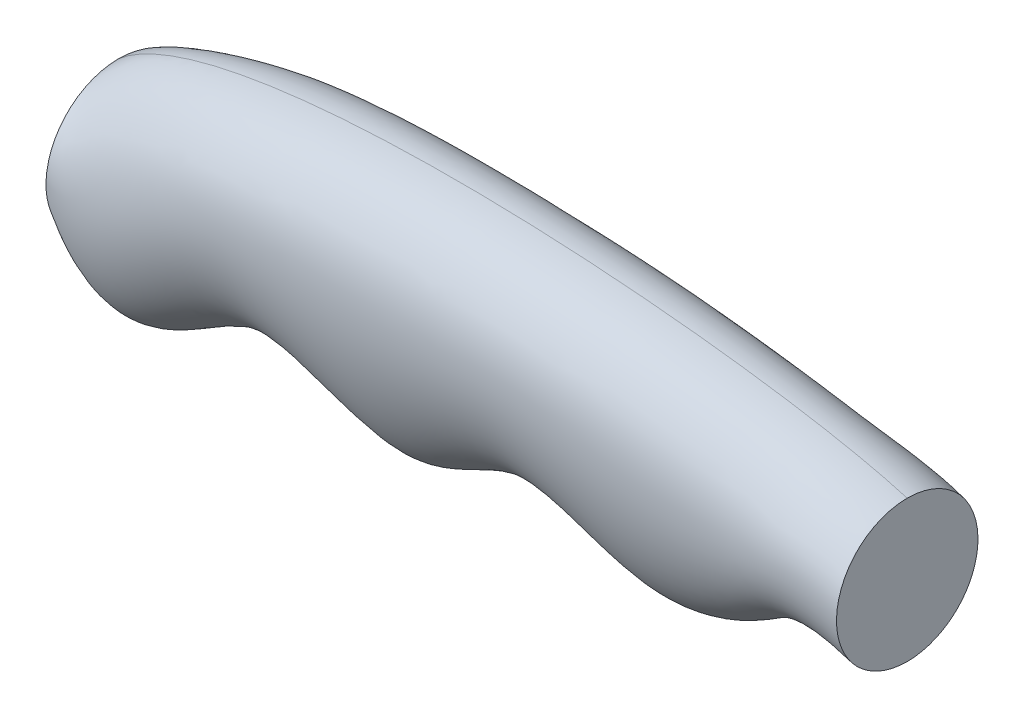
ISO-10303-21;
HEADER;
FILE_DESCRIPTION(('STEP AP214'),'2;1');
FILE_NAME('part.step','',(''),(''),'','','');
FILE_SCHEMA(('AUTOMOTIVE_DESIGN { 1 0 10303 214 1 1 1 1 }'));
ENDSEC;
DATA;
#1=APPLICATION_CONTEXT('core data for automotive mechanical design processes');
#2=APPLICATION_PROTOCOL_DEFINITION('international standard','automotive_design',2000,#1);
#3=PRODUCT_CONTEXT('',#1,'mechanical');
#4=PRODUCT('Part','Part','',(#3));
#5=PRODUCT_RELATED_PRODUCT_CATEGORY('part','',(#4));
#6=PRODUCT_DEFINITION_FORMATION('','',#4);
#7=PRODUCT_DEFINITION_CONTEXT('part definition',#1,'design');
#8=PRODUCT_DEFINITION('design','',#6,#7);
#9=PRODUCT_DEFINITION_SHAPE('','',#8);
#10=(LENGTH_UNIT() NAMED_UNIT(*) SI_UNIT(.MILLI.,.METRE.));
#11=(NAMED_UNIT(*) PLANE_ANGLE_UNIT() SI_UNIT($,.RADIAN.));
#12=(NAMED_UNIT(*) SI_UNIT($,.STERADIAN.) SOLID_ANGLE_UNIT());
#13=UNCERTAINTY_MEASURE_WITH_UNIT(LENGTH_MEASURE(1.E-05),#10,'distance_accuracy_value','');
#14=(GEOMETRIC_REPRESENTATION_CONTEXT(3) GLOBAL_UNCERTAINTY_ASSIGNED_CONTEXT((#13)) GLOBAL_UNIT_ASSIGNED_CONTEXT((#10,
#11,#12)) REPRESENTATION_CONTEXT('',''));
#15=CARTESIAN_POINT('',(0.,0.,0.));
#16=DIRECTION('',(0.,0.,1.));
#17=DIRECTION('',(1.,0.,0.));
#18=AXIS2_PLACEMENT_3D('',#15,#16,#17);
#19=CARTESIAN_POINT('',(0.,-38.8581281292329,0.));
#20=DIRECTION('',(-1.,0.,0.));
#21=DIRECTION('',(0.,0.,1.));
#22=AXIS2_PLACEMENT_3D('',#19,#20,#21);
#23=PLANE('',#22);
#24=CARTESIAN_POINT('',(0.,7.64559323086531,0.));
#25=CARTESIAN_POINT('',(0.,7.64871220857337,1.94638491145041));
#26=CARTESIAN_POINT('',(0.,6.59208279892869,5.59504325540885));
#27=CARTESIAN_POINT('',(0.,2.71240369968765,9.5263293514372));
#28=CARTESIAN_POINT('',(0.,-2.90614378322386,11.106547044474));
#29=CARTESIAN_POINT('',(0.,-8.52469126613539,9.5263293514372));
#30=CARTESIAN_POINT('',(0.,-12.4043703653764,5.59504325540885));
#31=CARTESIAN_POINT('',(0.,-13.4609997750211,1.94638491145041));
#32=CARTESIAN_POINT('',(0.,-13.457880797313,0.));
#33=B_SPLINE_CURVE_WITH_KNOTS('',3,(#24,#25,#26,#27,#28,#29,#30,#31,#32),.UNSPECIFIED.,.F.,.F.,
(4,1,1,1,1,1,4),(0.,0.166666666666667,0.333333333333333,0.5,0.666666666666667,0.833333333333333,
1.),.UNSPECIFIED.);
#34=CARTESIAN_POINT('',(0.,-13.457880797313,0.));
#35=VERTEX_POINT('',#34);
#36=CARTESIAN_POINT('',(0.,7.64559323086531,0.));
#37=VERTEX_POINT('',#36);
#38=EDGE_CURVE('E92',#35,#37,#33,.F.);
#39=ORIENTED_EDGE('',*,*,#38,.T.);
#40=CARTESIAN_POINT('',(0.,7.64559323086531,0.));
#41=CARTESIAN_POINT('',(0.,7.64871220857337,-1.94638491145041));
#42=CARTESIAN_POINT('',(0.,6.59208279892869,-5.59504325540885));
#43=CARTESIAN_POINT('',(0.,2.71240369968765,-9.5263293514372));
#44=CARTESIAN_POINT('',(0.,-2.90614378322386,-11.106547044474));
#45=CARTESIAN_POINT('',(0.,-8.52469126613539,-9.5263293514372));
#46=CARTESIAN_POINT('',(0.,-12.4043703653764,-5.59504325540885));
#47=CARTESIAN_POINT('',(0.,-13.4609997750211,-1.94638491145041));
#48=CARTESIAN_POINT('',(0.,-13.457880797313,0.));
#49=B_SPLINE_CURVE_WITH_KNOTS('',3,(#40,#41,#42,#43,#44,#45,#46,#47,#48),.UNSPECIFIED.,.F.,.F.,
(4,1,1,1,1,1,4),(0.,0.166666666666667,0.333333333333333,0.5,0.666666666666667,0.833333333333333,
1.),.UNSPECIFIED.);
#50=EDGE_CURVE('E105',#35,#37,#49,.F.);
#51=ORIENTED_EDGE('',*,*,#50,.F.);
#52=EDGE_LOOP('',(#39,#51));
#53=FACE_BOUND('',#52,.T.);
#54=ADVANCED_FACE('F73',(#53),#23,.T.);
#55=CARTESIAN_POINT('',(114.735758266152,-36.060217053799,0.));
#56=DIRECTION('',(-1.,0.,0.));
#57=DIRECTION('',(0.,0.,1.));
#58=AXIS2_PLACEMENT_3D('',#55,#56,#57);
#59=PLANE('',#58);
#60=CARTESIAN_POINT('',(114.735758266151,9.63403049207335,0.));
#61=CARTESIAN_POINT('',(114.735758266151,9.63403049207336,1.89440492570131));
#62=CARTESIAN_POINT('',(114.735758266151,8.59954797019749,5.44562251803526));
#63=CARTESIAN_POINT('',(114.735758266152,4.81437219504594,9.27192003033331));
#64=CARTESIAN_POINT('',(114.735758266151,-0.66323389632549,10.8099365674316));
#65=CARTESIAN_POINT('',(114.735758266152,-6.14083998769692,9.27192003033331));
#66=CARTESIAN_POINT('',(114.735758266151,-9.92601576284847,5.44562251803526));
#67=CARTESIAN_POINT('',(114.735758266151,-10.9604982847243,1.89440492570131));
#68=CARTESIAN_POINT('',(114.735758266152,-10.9604982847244,0.));
#69=B_SPLINE_CURVE_WITH_KNOTS('',3,(#60,#61,#62,#63,#64,#65,#66,#67,#68),.UNSPECIFIED.,.F.,.F.,
(4,1,1,1,1,1,4),(0.,0.166666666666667,0.333333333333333,0.5,0.666666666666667,0.833333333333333,
1.),.UNSPECIFIED.);
#70=CARTESIAN_POINT('',(114.735758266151,9.63403049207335,0.));
#71=VERTEX_POINT('',#70);
#72=CARTESIAN_POINT('',(114.735758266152,-10.9604982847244,0.));
#73=VERTEX_POINT('',#72);
#74=EDGE_CURVE('E84',#71,#73,#69,.T.);
#75=ORIENTED_EDGE('',*,*,#74,.T.);
#76=CARTESIAN_POINT('',(114.735758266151,9.63403049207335,0.));
#77=CARTESIAN_POINT('',(114.735758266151,9.63403049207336,-1.89440492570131));
#78=CARTESIAN_POINT('',(114.735758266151,8.59954797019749,-5.44562251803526));
#79=CARTESIAN_POINT('',(114.735758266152,4.81437219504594,-9.27192003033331));
#80=CARTESIAN_POINT('',(114.735758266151,-0.66323389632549,-10.8099365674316));
#81=CARTESIAN_POINT('',(114.735758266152,-6.14083998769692,-9.27192003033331));
#82=CARTESIAN_POINT('',(114.735758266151,-9.92601576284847,-5.44562251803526));
#83=CARTESIAN_POINT('',(114.735758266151,-10.9604982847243,-1.89440492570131));
#84=CARTESIAN_POINT('',(114.735758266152,-10.9604982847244,0.));
#85=B_SPLINE_CURVE_WITH_KNOTS('',3,(#76,#77,#78,#79,#80,#81,#82,#83,#84),.UNSPECIFIED.,.F.,.F.,
(4,1,1,1,1,1,4),(0.,0.166666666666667,0.333333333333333,0.5,0.666666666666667,0.833333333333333,
1.),.UNSPECIFIED.);
#86=EDGE_CURVE('E100',#71,#73,#85,.T.);
#87=ORIENTED_EDGE('',*,*,#86,.F.);
#88=EDGE_LOOP('',(#75,#87));
#89=FACE_BOUND('',#88,.T.);
#90=ADVANCED_FACE('F162',(#89),#59,.F.);
#91=CARTESIAN_POINT('',(0.,7.64559323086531,0.));
#92=CARTESIAN_POINT('',(0.,7.64871220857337,-1.94638491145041));
#93=CARTESIAN_POINT('',(0.,6.59208279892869,-5.59504325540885));
#94=CARTESIAN_POINT('',(0.,2.71240369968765,-9.5263293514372));
#95=CARTESIAN_POINT('',(0.,-2.90614378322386,-11.106547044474));
#96=CARTESIAN_POINT('',(0.,-8.52469126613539,-9.5263293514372));
#97=CARTESIAN_POINT('',(0.,-12.4043703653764,-5.59504325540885));
#98=CARTESIAN_POINT('',(0.,-13.4609997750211,-1.94638491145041));
#99=CARTESIAN_POINT('',(0.,-13.457880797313,0.));
#100=CARTESIAN_POINT('',(4.28123629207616,11.2990008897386,0.));
#101=CARTESIAN_POINT('',(4.28123629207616,11.2990008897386,-2.03696813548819));
#102=CARTESIAN_POINT('',(4.34624827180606,9.09349871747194,-5.77620970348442));
#103=CARTESIAN_POINT('',(4.57379020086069,1.18184852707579,-9.66220418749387));
#104=CARTESIAN_POINT('',(4.86634410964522,-9.62066178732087,-11.106547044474));
#105=CARTESIAN_POINT('',(5.15889801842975,-20.4231721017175,-9.39045451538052));
#106=CARTESIAN_POINT('',(5.38643994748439,-28.3348222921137,-5.41387680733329));
#107=CARTESIAN_POINT('',(5.45145192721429,-30.5403244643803,-1.85580168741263));
#108=CARTESIAN_POINT('',(5.45145192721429,-30.5403244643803,0.));
#109=CARTESIAN_POINT('',(17.2365845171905,15.3449290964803,0.));
#110=CARTESIAN_POINT('',(17.2365845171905,15.3449290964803,-2.18702637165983));
#111=CARTESIAN_POINT('',(17.5075824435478,14.3993665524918,-6.07165943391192));
#112=CARTESIAN_POINT('',(18.4560751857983,10.9003696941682,-9.86917928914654));
#113=CARTESIAN_POINT('',(19.6755658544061,5.77326610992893,-11.0760987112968));
#114=CARTESIAN_POINT('',(20.8950565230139,0.646162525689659,-9.13124700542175));
#115=CARTESIAN_POINT('',(21.8435492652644,-2.85283433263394,-5.08774972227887));
#116=CARTESIAN_POINT('',(22.1145471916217,-3.79839687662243,-1.6950715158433));
#117=CARTESIAN_POINT('',(22.1145471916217,-3.79839687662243,0.));
#118=CARTESIAN_POINT('',(42.5531016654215,17.1850946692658,0.));
#119=CARTESIAN_POINT('',(42.5531016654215,17.1850946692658,-3.11817212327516));
#120=CARTESIAN_POINT('',(42.6489641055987,14.8742180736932,-7.9218887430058));
#121=CARTESIAN_POINT('',(42.9844826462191,6.60402629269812,-11.2190829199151));
#122=CARTESIAN_POINT('',(43.4158636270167,-4.65231347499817,-10.9973984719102));
#123=CARTESIAN_POINT('',(43.8472446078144,-15.9086532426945,-7.64633752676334));
#124=CARTESIAN_POINT('',(44.1827631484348,-24.1788450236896,-3.15822821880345));
#125=CARTESIAN_POINT('',(44.278625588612,-26.4897216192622,-0.736341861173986));
#126=CARTESIAN_POINT('',(44.278625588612,-26.4897216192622,0.));
#127=CARTESIAN_POINT('',(65.3621080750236,16.7008415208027,0.));
#128=CARTESIAN_POINT('',(65.3621080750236,16.7008415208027,-2.15661463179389));
#129=CARTESIAN_POINT('',(65.2013449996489,15.4289344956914,-5.9876142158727));
#130=CARTESIAN_POINT('',(64.6386742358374,10.8019863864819,-9.73343499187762));
#131=CARTESIAN_POINT('',(63.915240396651,4.23458840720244,-10.9245876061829));
#132=CARTESIAN_POINT('',(63.1918065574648,-2.33280957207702,-9.00708249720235));
#133=CARTESIAN_POINT('',(62.6291357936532,-6.95975768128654,-5.01914422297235));
#134=CARTESIAN_POINT('',(62.4683727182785,-8.23166470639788,-1.67237963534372));
#135=CARTESIAN_POINT('',(62.4683727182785,-8.23166470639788,0.));
#136=CARTESIAN_POINT('',(86.5753216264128,14.8963776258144,0.));
#137=CARTESIAN_POINT('',(86.5753216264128,14.8963776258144,-2.86509117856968));
#138=CARTESIAN_POINT('',(86.1967910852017,12.9527869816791,-7.39487184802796));
#139=CARTESIAN_POINT('',(84.8719341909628,5.9808976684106,-10.7585204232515));
#140=CARTESIAN_POINT('',(83.1685467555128,-3.59727934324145,-10.8613292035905));
#141=CARTESIAN_POINT('',(81.4651593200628,-13.1754563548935,-7.87348082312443));
#142=CARTESIAN_POINT('',(80.1403024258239,-20.147345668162,-3.54815238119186));
#143=CARTESIAN_POINT('',(79.7617718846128,-22.0909363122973,-0.941731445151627));
#144=CARTESIAN_POINT('',(79.7617718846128,-22.0909363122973,0.));
#145=CARTESIAN_POINT('',(103.430372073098,12.424057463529,0.));
#146=CARTESIAN_POINT('',(103.430372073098,12.424057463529,-2.18658887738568));
#147=CARTESIAN_POINT('',(103.120434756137,11.040750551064,-6.03154814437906));
#148=CARTESIAN_POINT('',(102.035654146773,6.03373321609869,-9.71624169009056));
#149=CARTESIAN_POINT('',(100.640936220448,-1.01547804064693,-10.8200999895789));
#150=CARTESIAN_POINT('',(99.2462182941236,-8.06468929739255,-8.84503315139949));
#151=CARTESIAN_POINT('',(98.1614376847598,-13.0717066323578,-4.86993675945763));
#152=CARTESIAN_POINT('',(97.8515003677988,-14.4550135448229,-1.60578318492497));
#153=CARTESIAN_POINT('',(97.8515003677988,-14.4550135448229,0.));
#154=CARTESIAN_POINT('',(111.737408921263,10.5187893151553,0.));
#155=CARTESIAN_POINT('',(111.737408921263,10.5187893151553,-1.98524502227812));
#156=CARTESIAN_POINT('',(111.335127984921,9.6167439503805,-5.62730271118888));
#157=CARTESIAN_POINT('',(109.927144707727,6.29509822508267,-9.40818017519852));
#158=CARTESIAN_POINT('',(108.11688049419,1.41345934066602,-10.8099365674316));
#159=CARTESIAN_POINT('',(106.306616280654,-3.46817954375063,-9.1356598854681));
#160=CARTESIAN_POINT('',(104.89863300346,-6.78982526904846,-5.26394232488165));
#161=CARTESIAN_POINT('',(104.496352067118,-7.69187063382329,-1.80356482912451));
#162=CARTESIAN_POINT('',(104.496352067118,-7.69187063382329,0.));
#163=CARTESIAN_POINT('',(114.735758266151,9.63403049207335,0.));
#164=CARTESIAN_POINT('',(114.735758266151,9.63403049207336,-1.89440492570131));
#165=CARTESIAN_POINT('',(114.735758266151,8.59954797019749,-5.44562251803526));
#166=CARTESIAN_POINT('',(114.735758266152,4.81437219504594,-9.27192003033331));
#167=CARTESIAN_POINT('',(114.735758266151,-0.66323389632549,-10.8099365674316));
#168=CARTESIAN_POINT('',(114.735758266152,-6.14083998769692,-9.27192003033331));
#169=CARTESIAN_POINT('',(114.735758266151,-9.92601576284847,-5.44562251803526));
#170=CARTESIAN_POINT('',(114.735758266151,-10.9604982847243,-1.89440492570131));
#171=CARTESIAN_POINT('',(114.735758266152,-10.9604982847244,0.));
#172=B_SPLINE_SURFACE_WITH_KNOTS('',3,3,((#91,#92,#93,#94,#95,#96,#97,#98,#99),(#100,#101,#102,
#103,#104,#105,#106,#107,#108),(#109,#110,#111,#112,#113,#114,#115,#116,#117),(#118,#119,#120,
#121,#122,#123,#124,#125,#126),(#127,#128,#129,#130,#131,#132,#133,#134,#135),(#136,#137,#138,
#139,#140,#141,#142,#143,#144),(#145,#146,#147,#148,#149,#150,#151,#152,#153),(#154,#155,#156,
#157,#158,#159,#160,#161,#162),(#163,#164,#165,#166,#167,#168,#169,#170,#171)),.UNSPECIFIED.,
.F.,.F.,.F.,(4,1,1,1,1,1,4),(4,1,1,1,1,1,4),(0.,0.246938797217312,0.415707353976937,
0.580166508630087,0.724970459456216,0.875412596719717,1.),(0.,0.166666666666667,
0.333333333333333,0.5,0.666666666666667,0.833333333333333,1.),.UNSPECIFIED.);
#173=CARTESIAN_POINT('',(0.,7.64559323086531,0.));
#174=CARTESIAN_POINT('',(4.28123629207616,11.2990008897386,0.));
#175=CARTESIAN_POINT('',(17.2365845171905,15.3449290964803,0.));
#176=CARTESIAN_POINT('',(42.5531016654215,17.1850946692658,0.));
#177=CARTESIAN_POINT('',(65.3621080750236,16.7008415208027,0.));
#178=CARTESIAN_POINT('',(86.5753216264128,14.8963776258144,0.));
#179=CARTESIAN_POINT('',(103.430372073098,12.424057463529,0.));
#180=CARTESIAN_POINT('',(111.737408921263,10.5187893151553,0.));
#181=CARTESIAN_POINT('',(114.735758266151,9.63403049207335,0.));
#182=B_SPLINE_CURVE_WITH_KNOTS('',3,(#173,#174,#175,#176,#177,#178,#179,#180,#181),
.UNSPECIFIED.,.F.,.F.,(4,1,1,1,1,1,4),(0.,0.246938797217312,0.415707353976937,0.580166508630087,
0.724970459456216,0.875412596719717,1.),.UNSPECIFIED.);
#183=EDGE_CURVE('E13',#37,#71,#182,.T.);
#184=CARTESIAN_POINT('',(0.,-13.457880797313,0.));
#185=CARTESIAN_POINT('',(5.45145192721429,-30.5403244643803,0.));
#186=CARTESIAN_POINT('',(22.1145471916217,-3.79839687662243,0.));
#187=CARTESIAN_POINT('',(44.278625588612,-26.4897216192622,0.));
#188=CARTESIAN_POINT('',(62.4683727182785,-8.23166470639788,0.));
#189=CARTESIAN_POINT('',(79.7617718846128,-22.0909363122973,0.));
#190=CARTESIAN_POINT('',(97.8515003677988,-14.4550135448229,0.));
#191=CARTESIAN_POINT('',(104.496352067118,-7.69187063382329,0.));
#192=CARTESIAN_POINT('',(114.735758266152,-10.9604982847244,0.));
#193=B_SPLINE_CURVE_WITH_KNOTS('',3,(#184,#185,#186,#187,#188,#189,#190,#191,#192),
.UNSPECIFIED.,.F.,.F.,(4,1,1,1,1,1,4),(0.,0.246938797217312,0.415707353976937,0.580166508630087,
0.724970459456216,0.875412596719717,1.),.UNSPECIFIED.);
#194=EDGE_CURVE('E107',#73,#35,#193,.F.);
#195=ORIENTED_EDGE('',*,*,#183,.T.);
#196=ORIENTED_EDGE('',*,*,#86,.T.);
#197=ORIENTED_EDGE('',*,*,#194,.T.);
#198=ORIENTED_EDGE('',*,*,#50,.T.);
#199=EDGE_LOOP('',(#195,#196,#197,#198));
#200=FACE_BOUND('',#199,.T.);
#201=ADVANCED_FACE('F106',(#200),#172,.T.);
#202=CARTESIAN_POINT('',(0.,7.64559323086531,0.));
#203=CARTESIAN_POINT('',(0.,7.64871220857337,1.94638491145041));
#204=CARTESIAN_POINT('',(0.,6.59208279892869,5.59504325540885));
#205=CARTESIAN_POINT('',(0.,2.71240369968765,9.5263293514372));
#206=CARTESIAN_POINT('',(0.,-2.90614378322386,11.106547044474));
#207=CARTESIAN_POINT('',(0.,-8.52469126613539,9.5263293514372));
#208=CARTESIAN_POINT('',(0.,-12.4043703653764,5.59504325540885));
#209=CARTESIAN_POINT('',(0.,-13.4609997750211,1.94638491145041));
#210=CARTESIAN_POINT('',(0.,-13.457880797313,0.));
#211=CARTESIAN_POINT('',(4.28123629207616,11.2990008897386,0.));
#212=CARTESIAN_POINT('',(4.28123629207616,11.2990008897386,2.03696813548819));
#213=CARTESIAN_POINT('',(4.34624827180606,9.09349871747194,5.77620970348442));
#214=CARTESIAN_POINT('',(4.57379020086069,1.18184852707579,9.66220418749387));
#215=CARTESIAN_POINT('',(4.86634410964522,-9.62066178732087,11.106547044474));
#216=CARTESIAN_POINT('',(5.15889801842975,-20.4231721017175,9.39045451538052));
#217=CARTESIAN_POINT('',(5.38643994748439,-28.3348222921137,5.41387680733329));
#218=CARTESIAN_POINT('',(5.45145192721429,-30.5403244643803,1.85580168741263));
#219=CARTESIAN_POINT('',(5.45145192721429,-30.5403244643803,0.));
#220=CARTESIAN_POINT('',(17.2365845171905,15.3449290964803,0.));
#221=CARTESIAN_POINT('',(17.2365845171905,15.3449290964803,2.18702637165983));
#222=CARTESIAN_POINT('',(17.5075824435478,14.3993665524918,6.07165943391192));
#223=CARTESIAN_POINT('',(18.4560751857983,10.9003696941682,9.86917928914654));
#224=CARTESIAN_POINT('',(19.6755658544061,5.77326610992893,11.0760987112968));
#225=CARTESIAN_POINT('',(20.8950565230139,0.646162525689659,9.13124700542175));
#226=CARTESIAN_POINT('',(21.8435492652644,-2.85283433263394,5.08774972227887));
#227=CARTESIAN_POINT('',(22.1145471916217,-3.79839687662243,1.6950715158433));
#228=CARTESIAN_POINT('',(22.1145471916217,-3.79839687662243,0.));
#229=CARTESIAN_POINT('',(42.5531016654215,17.1850946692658,0.));
#230=CARTESIAN_POINT('',(42.5531016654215,17.1850946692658,3.11817212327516));
#231=CARTESIAN_POINT('',(42.6489641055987,14.8742180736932,7.9218887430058));
#232=CARTESIAN_POINT('',(42.9844826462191,6.60402629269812,11.2190829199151));
#233=CARTESIAN_POINT('',(43.4158636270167,-4.65231347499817,10.9973984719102));
#234=CARTESIAN_POINT('',(43.8472446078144,-15.9086532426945,7.64633752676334));
#235=CARTESIAN_POINT('',(44.1827631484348,-24.1788450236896,3.15822821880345));
#236=CARTESIAN_POINT('',(44.278625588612,-26.4897216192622,0.736341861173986));
#237=CARTESIAN_POINT('',(44.278625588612,-26.4897216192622,0.));
#238=CARTESIAN_POINT('',(65.3621080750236,16.7008415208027,0.));
#239=CARTESIAN_POINT('',(65.3621080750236,16.7008415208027,2.15661463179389));
#240=CARTESIAN_POINT('',(65.2013449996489,15.4289344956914,5.9876142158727));
#241=CARTESIAN_POINT('',(64.6386742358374,10.8019863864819,9.73343499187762));
#242=CARTESIAN_POINT('',(63.915240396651,4.23458840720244,10.9245876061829));
#243=CARTESIAN_POINT('',(63.1918065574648,-2.33280957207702,9.00708249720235));
#244=CARTESIAN_POINT('',(62.6291357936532,-6.95975768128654,5.01914422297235));
#245=CARTESIAN_POINT('',(62.4683727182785,-8.23166470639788,1.67237963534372));
#246=CARTESIAN_POINT('',(62.4683727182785,-8.23166470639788,0.));
#247=CARTESIAN_POINT('',(86.5753216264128,14.8963776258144,0.));
#248=CARTESIAN_POINT('',(86.5753216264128,14.8963776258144,2.86509117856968));
#249=CARTESIAN_POINT('',(86.1967910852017,12.9527869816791,7.39487184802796));
#250=CARTESIAN_POINT('',(84.8719341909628,5.9808976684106,10.7585204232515));
#251=CARTESIAN_POINT('',(83.1685467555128,-3.59727934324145,10.8613292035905));
#252=CARTESIAN_POINT('',(81.4651593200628,-13.1754563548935,7.87348082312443));
#253=CARTESIAN_POINT('',(80.1403024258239,-20.147345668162,3.54815238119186));
#254=CARTESIAN_POINT('',(79.7617718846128,-22.0909363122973,0.941731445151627));
#255=CARTESIAN_POINT('',(79.7617718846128,-22.0909363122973,0.));
#256=CARTESIAN_POINT('',(103.430372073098,12.424057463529,0.));
#257=CARTESIAN_POINT('',(103.430372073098,12.424057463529,2.18658887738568));
#258=CARTESIAN_POINT('',(103.120434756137,11.040750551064,6.03154814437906));
#259=CARTESIAN_POINT('',(102.035654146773,6.03373321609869,9.71624169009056));
#260=CARTESIAN_POINT('',(100.640936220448,-1.01547804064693,10.8200999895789));
#261=CARTESIAN_POINT('',(99.2462182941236,-8.06468929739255,8.84503315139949));
#262=CARTESIAN_POINT('',(98.1614376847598,-13.0717066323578,4.86993675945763));
#263=CARTESIAN_POINT('',(97.8515003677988,-14.4550135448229,1.60578318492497));
#264=CARTESIAN_POINT('',(97.8515003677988,-14.4550135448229,0.));
#265=CARTESIAN_POINT('',(111.737408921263,10.5187893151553,0.));
#266=CARTESIAN_POINT('',(111.737408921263,10.5187893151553,1.98524502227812));
#267=CARTESIAN_POINT('',(111.335127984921,9.6167439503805,5.62730271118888));
#268=CARTESIAN_POINT('',(109.927144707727,6.29509822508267,9.40818017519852));
#269=CARTESIAN_POINT('',(108.11688049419,1.41345934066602,10.8099365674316));
#270=CARTESIAN_POINT('',(106.306616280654,-3.46817954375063,9.1356598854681));
#271=CARTESIAN_POINT('',(104.89863300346,-6.78982526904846,5.26394232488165));
#272=CARTESIAN_POINT('',(104.496352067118,-7.69187063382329,1.80356482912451));
#273=CARTESIAN_POINT('',(104.496352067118,-7.69187063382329,0.));
#274=CARTESIAN_POINT('',(114.735758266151,9.63403049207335,0.));
#275=CARTESIAN_POINT('',(114.735758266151,9.63403049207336,1.89440492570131));
#276=CARTESIAN_POINT('',(114.735758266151,8.59954797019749,5.44562251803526));
#277=CARTESIAN_POINT('',(114.735758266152,4.81437219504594,9.27192003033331));
#278=CARTESIAN_POINT('',(114.735758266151,-0.66323389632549,10.8099365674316));
#279=CARTESIAN_POINT('',(114.735758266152,-6.14083998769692,9.27192003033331));
#280=CARTESIAN_POINT('',(114.735758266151,-9.92601576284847,5.44562251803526));
#281=CARTESIAN_POINT('',(114.735758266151,-10.9604982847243,1.89440492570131));
#282=CARTESIAN_POINT('',(114.735758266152,-10.9604982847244,0.));
#283=B_SPLINE_SURFACE_WITH_KNOTS('',3,3,((#202,#203,#204,#205,#206,#207,#208,#209,#210),(#211,
#212,#213,#214,#215,#216,#217,#218,#219),(#220,#221,#222,#223,#224,#225,#226,#227,#228),(#229,
#230,#231,#232,#233,#234,#235,#236,#237),(#238,#239,#240,#241,#242,#243,#244,#245,#246),(#247,
#248,#249,#250,#251,#252,#253,#254,#255),(#256,#257,#258,#259,#260,#261,#262,#263,#264),(#265,
#266,#267,#268,#269,#270,#271,#272,#273),(#274,#275,#276,#277,#278,#279,#280,#281,#282)),
.UNSPECIFIED.,.F.,.F.,.F.,(4,1,1,1,1,1,4),(4,1,1,1,1,1,4),(0.,0.246938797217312,
0.415707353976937,0.580166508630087,0.724970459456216,0.875412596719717,1.),(0.,
0.166666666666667,0.333333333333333,0.5,0.666666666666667,0.833333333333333,1.),.UNSPECIFIED.);
#284=ORIENTED_EDGE('',*,*,#183,.F.);
#285=ORIENTED_EDGE('',*,*,#38,.F.);
#286=ORIENTED_EDGE('',*,*,#194,.F.);
#287=ORIENTED_EDGE('',*,*,#74,.F.);
#288=EDGE_LOOP('',(#284,#285,#286,#287));
#289=FACE_BOUND('',#288,.T.);
#290=ADVANCED_FACE('F111',(#289),#283,.F.);
#291=CLOSED_SHELL('',(#54,#90,#201,#290));
#292=MANIFOLD_SOLID_BREP('B2',#291);
#293=ADVANCED_BREP_SHAPE_REPRESENTATION('',(#18,#292),#14);
#294=SHAPE_DEFINITION_REPRESENTATION(#9,#293);
ENDSEC;
END-ISO-10303-21;
